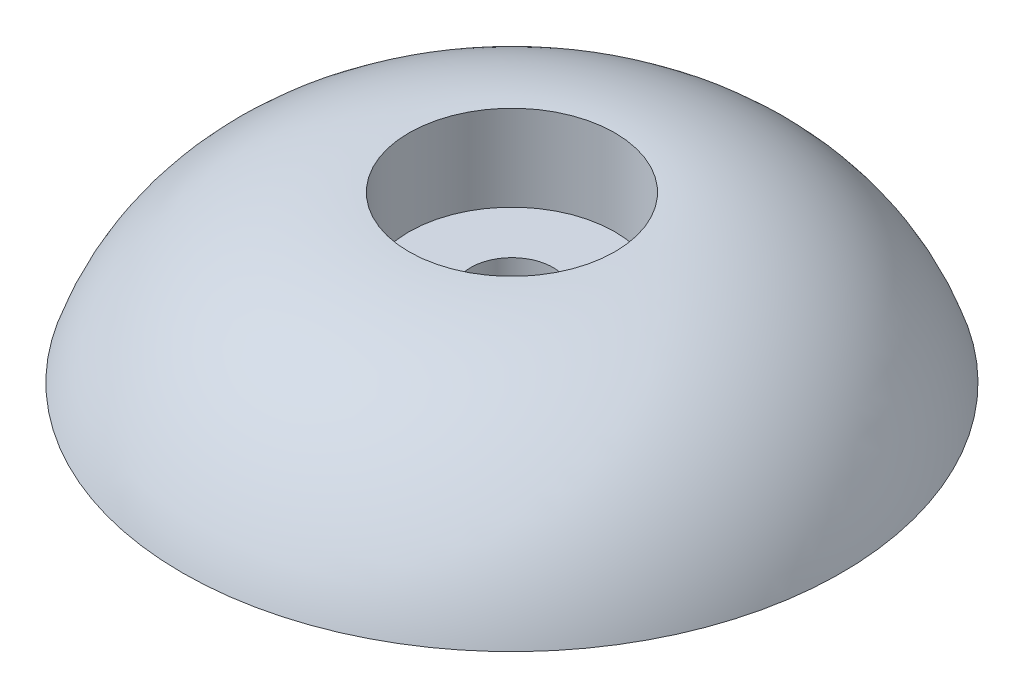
from build123d import *


with BuildPart() as part:
    # Sketch1 → Revolve1 (revolve)
    with BuildSketch(Plane(origin=(0, 0, 0), x_dir=(0, 0, -1), z_dir=(1, 0, 0)), mode=Mode.PRIVATE) as revolve1_sk:
        with BuildLine():
            Line((6.35, 0), (6.35, 12.192))
            Line((6.35, 12.192), (15.875, 12.192))
            Line((15.875, 12.192), (15.875, 25.4))
            ThreePointArc((15.875, 25.4), (37.467334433, 18.378522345), (50.8, 0))
            Line((50.8, 0), (6.35, 0))
        make_face()
    revolve(revolve1_sk.sketch.rotate(Axis((0, 0, 0), (0, -1, 0)), 180), axis=Axis((0, 0, 0), (0, -1, 0)))


solid = part.part
